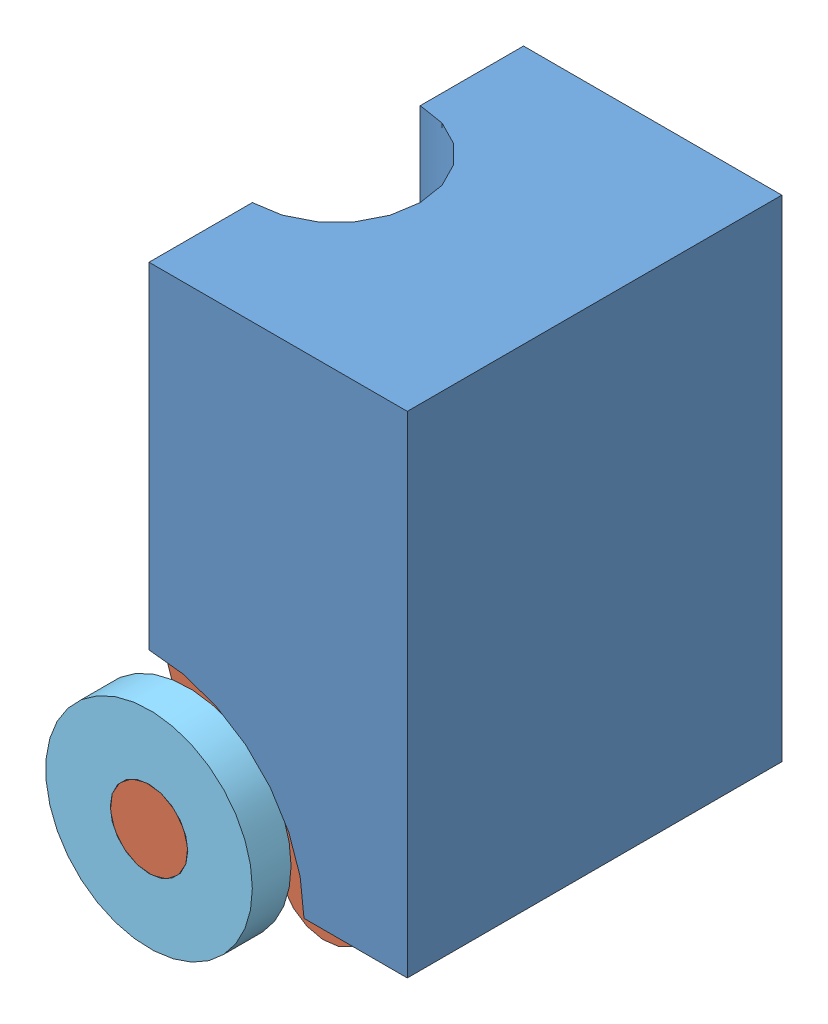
SolidWorks assembly Piston.SLDASM, configuration Default (file format 11000). Lengths in mm.
Overall size (312.3 514.88 290).
6 component instances, 5 part files, 12 mates.
Components (placement in the parent):
- engineblock-1: engineblock.sldprt [Default] at origin size (204.5 380 290)
- crankshaft-1: crankshaft.sldprt [Default] at (-845.5509 -86.1819 0) x (-0.453825 0.891091 0) z (0 0 1) size (225.71 140 290)
- conrod-1: conrod.sldprt [Default] at (-760.1543 24.2134 627.805) x (-0.976533 0.215367 0) z (0 0 -1) size (137.5 251.66 50)
- piston-1: piston.sldprt [Default] at (0 -58.6143 0) size (130 100 130)
- bearing-2: bearing.sldprt [Default] at (0 0 458.9025) size (160 160 30)
- bearing-3: bearing.sldprt [Default] at (0 0 198.9025) size (160 160 30)
Mates (geometry in assembly coordinates):
- Concentric6: concentric: cylinder of assembly; cylinder of assembly; cylinder of engineblock-1 through (-396.3638 -302.222 313.9025) axis (0 1 0) radius 65; cylinder of piston-1 through (-396.3638 -91.6714 313.9025) axis (0 1 0) radius 60
- Concentric7: concentric: cylinder of assembly; cylinder of assembly; cylinder of conrod-1 through (-396.3638 -166.6714 338.9025) axis (0 0 -1) radius 10; cylinder of piston-1 through (-396.3638 -166.6714 253.9025) axis (0 0 1) radius 10
- Hinge2: hinge: cylinder of assembly; plane of assembly; cylinder of assembly; plane of assembly; cylinder of crankshaft-1 through (-360.0577 -373.5092 338.9025) axis (0 0 -1) radius 20; cylinder of conrod-1 through (-360.0577 -373.5092 338.9025) axis (0 0 -1) radius 20; plane of conrod-1 through (-360.0577 -373.5092 338.9025) normal (0 0 1); plane of crankshaft-1 through (-396.3638 -302.222 338.9025) normal (0 0 -1)
- Hinge5: hinge: cylinder of assembly; plane of assembly; cylinder of assembly; plane of assembly; cylinder of crankshaft-1 through (-396.3638 -302.222 458.9025) axis (0 0 -1) radius 30; cylinder of bearing-2 through (-396.3638 -302.222 428.9025) axis (0 0 1) radius 30; plane of crankshaft-1 through (-396.3638 -302.222 458.9025) normal (0 0 1); plane of bearing-2 through (-396.3638 -302.222 458.9025) normal (0 0 1)
- Hinge6: hinge: cylinder of assembly; plane of assembly; cylinder of assembly; plane of assembly; cylinder of crankshaft-1 through (-396.3638 -302.222 458.9025) axis (0 0 -1) radius 30; cylinder of bearing-2 through (-396.3638 -302.222 428.9025) axis (0 0 1) radius 30; plane of crankshaft-1 through (-396.3638 -302.222 458.9025) normal (0 0 1); plane of bearing-2 through (-396.3638 -302.222 458.9025) normal (0 0 1)
- Hinge7: hinge: cylinder of assembly; plane of assembly; cylinder of assembly; plane of assembly; cylinder of conrod-1 through (-360.0577 -373.5092 338.9025) axis (0 0 -1) radius 20; cylinder of crankshaft-1 through (-360.0577 -373.5092 338.9025) axis (0 0 -1) radius 20; plane of conrod-1 through (-360.0577 -373.5092 338.9025) normal (0 0 1); plane of crankshaft-1 through (-396.3638 -302.222 338.9025) normal (0 0 -1)
- Concentric8: concentric: cylinder of assembly; cone of assembly; cylinder of engineblock-1 through (-396.3638 -302.222 313.9025) axis (0 1 0) radius 65; cone of piston-1 through (-396.3638 -191.6714 313.9025) axis (0 1 0)
- Concentric9: concentric: cylinder of assembly; cylinder of assembly; cylinder of conrod-1 through (-396.3638 -166.6714 338.9025) axis (0 0 -1) radius 10; cylinder of piston-1 through (-396.3638 -166.6714 253.9025) axis (0 0 1) radius 10
- Hinge8: hinge: cylinder of assembly; plane of assembly; cylinder of assembly; plane of assembly; cylinder of crankshaft-1 through (-396.3638 -302.222 458.9025) axis (0 0 -1) radius 30; cylinder of bearing-2 through (-396.3638 -302.222 428.9025) axis (0 0 1) radius 30; plane of crankshaft-1 through (-396.3638 -302.222 458.9025) normal (0 0 1); plane of bearing-2 through (-396.3638 -302.222 458.9025) normal (0 0 1)
- Hinge9: hinge: cylinder of assembly; plane of assembly; cylinder of assembly; plane of assembly; cylinder of conrod-1 through (-360.0577 -373.5092 338.9025) axis (0 0 -1) radius 20; cylinder of crankshaft-1 through (-360.0577 -373.5092 338.9025) axis (0 0 -1) radius 20; plane of conrod-1 through (-360.0577 -373.5092 338.9025) normal (0 0 1); plane of crankshaft-1 through (-396.3638 -302.222 338.9025) normal (0 0 -1)
- Concentric11: concentric: cylinder of assembly; cylinder of assembly; cylinder of engineblock-1 through (-396.3638 -302.222 313.9025) axis (0 1 0) radius 65; cylinder of piston-1 through (-396.3638 -91.6714 313.9025) axis (0 1 0) radius 60
- Concentric12: concentric: cylinder of assembly; cylinder of assembly; cylinder of conrod-1 through (-396.3638 -166.6714 338.9025) axis (0 0 -1) radius 10; cylinder of piston-1 through (-396.3638 -166.6714 253.9025) axis (0 0 1) radius 10
